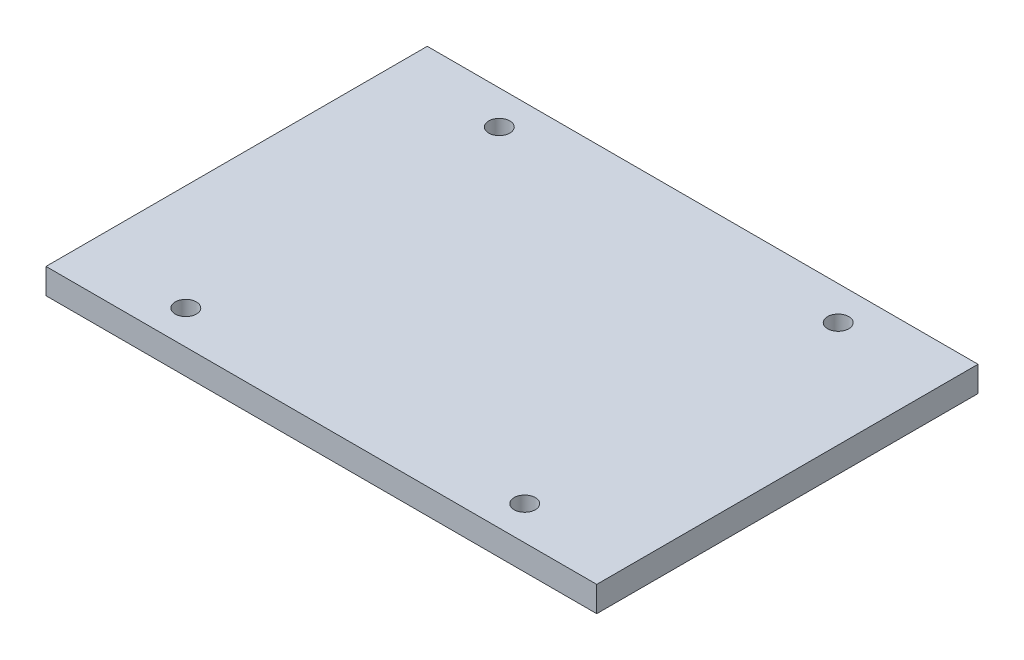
ISO-10303-21;
HEADER;
FILE_DESCRIPTION(('STEP AP214'),'2;1');
FILE_NAME('part.step','',(''),(''),'','','');
FILE_SCHEMA(('AUTOMOTIVE_DESIGN { 1 0 10303 214 1 1 1 1 }'));
ENDSEC;
DATA;
#1=APPLICATION_CONTEXT('core data for automotive mechanical design processes');
#2=APPLICATION_PROTOCOL_DEFINITION('international standard','automotive_design',2000,#1);
#3=PRODUCT_CONTEXT('',#1,'mechanical');
#4=PRODUCT('Part','Part','',(#3));
#5=PRODUCT_RELATED_PRODUCT_CATEGORY('part','',(#4));
#6=PRODUCT_DEFINITION_FORMATION('','',#4);
#7=PRODUCT_DEFINITION_CONTEXT('part definition',#1,'design');
#8=PRODUCT_DEFINITION('design','',#6,#7);
#9=PRODUCT_DEFINITION_SHAPE('','',#8);
#10=(LENGTH_UNIT() NAMED_UNIT(*) SI_UNIT(.MILLI.,.METRE.));
#11=(NAMED_UNIT(*) PLANE_ANGLE_UNIT() SI_UNIT($,.RADIAN.));
#12=(NAMED_UNIT(*) SI_UNIT($,.STERADIAN.) SOLID_ANGLE_UNIT());
#13=UNCERTAINTY_MEASURE_WITH_UNIT(LENGTH_MEASURE(1.E-05),#10,'distance_accuracy_value','');
#14=(GEOMETRIC_REPRESENTATION_CONTEXT(3) GLOBAL_UNCERTAINTY_ASSIGNED_CONTEXT((#13)) GLOBAL_UNIT_ASSIGNED_CONTEXT((#10,
#11,#12)) REPRESENTATION_CONTEXT('',''));
#15=CARTESIAN_POINT('',(0.,0.,0.));
#16=DIRECTION('',(0.,0.,1.));
#17=DIRECTION('',(1.,0.,0.));
#18=AXIS2_PLACEMENT_3D('',#15,#16,#17);
#19=CARTESIAN_POINT('',(0.,3.,0.));
#20=DIRECTION('',(0.,1.,0.));
#21=DIRECTION('',(0.,0.,1.));
#22=AXIS2_PLACEMENT_3D('',#19,#20,#21);
#23=PLANE('',#22);
#24=CARTESIAN_POINT('',(20.,3.,18.5));
#25=DIRECTION('',(0.,1.,0.));
#26=DIRECTION('',(0.,0.,1.));
#27=AXIS2_PLACEMENT_3D('',#24,#25,#26);
#28=CIRCLE('',#27,1.25);
#29=CARTESIAN_POINT('',(20.,3.,19.75));
#30=VERTEX_POINT('',#29);
#31=EDGE_CURVE('E146',#30,#30,#28,.T.);
#32=ORIENTED_EDGE('',*,*,#31,.F.);
#33=EDGE_LOOP('',(#32));
#34=FACE_BOUND('',#33,.T.);
#35=CARTESIAN_POINT('',(-20.,3.,-18.5));
#36=DIRECTION('',(0.,1.,0.));
#37=DIRECTION('',(0.,0.,1.));
#38=AXIS2_PLACEMENT_3D('',#35,#36,#37);
#39=CIRCLE('',#38,1.25);
#40=CARTESIAN_POINT('',(-20.,3.,-17.25));
#41=VERTEX_POINT('',#40);
#42=EDGE_CURVE('E116',#41,#41,#39,.T.);
#43=ORIENTED_EDGE('',*,*,#42,.F.);
#44=EDGE_LOOP('',(#43));
#45=FACE_BOUND('',#44,.T.);
#46=DIRECTION('',(0.,0.,1.));
#47=VECTOR('',#46,1.);
#48=CARTESIAN_POINT('',(-32.5,3.,22.5));
#49=LINE('',#48,#47);
#50=CARTESIAN_POINT('',(-32.5,3.,-22.5));
#51=VERTEX_POINT('',#50);
#52=CARTESIAN_POINT('',(-32.5,3.,22.5));
#53=VERTEX_POINT('',#52);
#54=EDGE_CURVE('E96',#51,#53,#49,.T.);
#55=ORIENTED_EDGE('',*,*,#54,.T.);
#56=DIRECTION('',(1.,0.,0.));
#57=VECTOR('',#56,1.);
#58=CARTESIAN_POINT('',(32.5,3.,22.5));
#59=LINE('',#58,#57);
#60=CARTESIAN_POINT('',(32.5,3.,22.5));
#61=VERTEX_POINT('',#60);
#62=EDGE_CURVE('E91',#53,#61,#59,.T.);
#63=ORIENTED_EDGE('',*,*,#62,.T.);
#64=DIRECTION('',(0.,0.,-1.));
#65=VECTOR('',#64,1.);
#66=CARTESIAN_POINT('',(32.5,3.,22.5));
#67=LINE('',#66,#65);
#68=CARTESIAN_POINT('',(32.5,3.,-22.5));
#69=VERTEX_POINT('',#68);
#70=EDGE_CURVE('E94',#61,#69,#67,.T.);
#71=ORIENTED_EDGE('',*,*,#70,.T.);
#72=DIRECTION('',(-1.,0.,0.));
#73=VECTOR('',#72,1.);
#74=CARTESIAN_POINT('',(32.5,3.,-22.5));
#75=LINE('',#74,#73);
#76=EDGE_CURVE('E61',#69,#51,#75,.T.);
#77=ORIENTED_EDGE('',*,*,#76,.T.);
#78=EDGE_LOOP('',(#55,#63,#71,#77));
#79=FACE_BOUND('',#78,.T.);
#80=CARTESIAN_POINT('',(-20.,3.,18.5));
#81=DIRECTION('',(0.,1.,0.));
#82=DIRECTION('',(0.,0.,1.));
#83=AXIS2_PLACEMENT_3D('',#80,#81,#82);
#84=CIRCLE('',#83,1.25);
#85=CARTESIAN_POINT('',(-20.,3.,19.75));
#86=VERTEX_POINT('',#85);
#87=EDGE_CURVE('E138',#86,#86,#84,.T.);
#88=ORIENTED_EDGE('',*,*,#87,.F.);
#89=EDGE_LOOP('',(#88));
#90=FACE_BOUND('',#89,.T.);
#91=CARTESIAN_POINT('',(20.,3.,-18.5));
#92=DIRECTION('',(0.,1.,0.));
#93=DIRECTION('',(0.,0.,1.));
#94=AXIS2_PLACEMENT_3D('',#91,#92,#93);
#95=CIRCLE('',#94,1.25);
#96=CARTESIAN_POINT('',(20.,3.,-17.25));
#97=VERTEX_POINT('',#96);
#98=EDGE_CURVE('E154',#97,#97,#95,.T.);
#99=ORIENTED_EDGE('',*,*,#98,.F.);
#100=EDGE_LOOP('',(#99));
#101=FACE_BOUND('',#100,.T.);
#102=ADVANCED_FACE('F43',(#34,#45,#79,#90,#101),#23,.T.);
#103=CARTESIAN_POINT('',(0.,0.,0.));
#104=DIRECTION('',(0.,1.,0.));
#105=DIRECTION('',(0.,0.,1.));
#106=AXIS2_PLACEMENT_3D('',#103,#104,#105);
#107=PLANE('',#106);
#108=DIRECTION('',(0.,0.,1.));
#109=VECTOR('',#108,1.);
#110=CARTESIAN_POINT('',(-32.5,0.,22.5));
#111=LINE('',#110,#109);
#112=CARTESIAN_POINT('',(-32.5,0.,-22.5));
#113=VERTEX_POINT('',#112);
#114=CARTESIAN_POINT('',(-32.5,0.,22.5));
#115=VERTEX_POINT('',#114);
#116=EDGE_CURVE('E112',#113,#115,#111,.T.);
#117=ORIENTED_EDGE('',*,*,#116,.F.);
#118=DIRECTION('',(-1.,0.,0.));
#119=VECTOR('',#118,1.);
#120=CARTESIAN_POINT('',(32.5,0.,-22.5));
#121=LINE('',#120,#119);
#122=CARTESIAN_POINT('',(32.5,0.,-22.5));
#123=VERTEX_POINT('',#122);
#124=EDGE_CURVE('E84',#123,#113,#121,.T.);
#125=ORIENTED_EDGE('',*,*,#124,.F.);
#126=DIRECTION('',(0.,0.,-1.));
#127=VECTOR('',#126,1.);
#128=CARTESIAN_POINT('',(32.5,0.,22.5));
#129=LINE('',#128,#127);
#130=CARTESIAN_POINT('',(32.5,0.,22.5));
#131=VERTEX_POINT('',#130);
#132=EDGE_CURVE('E78',#131,#123,#129,.T.);
#133=ORIENTED_EDGE('',*,*,#132,.F.);
#134=DIRECTION('',(1.,0.,0.));
#135=VECTOR('',#134,1.);
#136=CARTESIAN_POINT('',(32.5,0.,22.5));
#137=LINE('',#136,#135);
#138=EDGE_CURVE('E101',#115,#131,#137,.T.);
#139=ORIENTED_EDGE('',*,*,#138,.F.);
#140=EDGE_LOOP('',(#117,#125,#133,#139));
#141=FACE_BOUND('',#140,.T.);
#142=CARTESIAN_POINT('',(-20.,0.,-18.5));
#143=DIRECTION('',(0.,1.,0.));
#144=DIRECTION('',(0.,0.,1.));
#145=AXIS2_PLACEMENT_3D('',#142,#143,#144);
#146=CIRCLE('',#145,1.25);
#147=CARTESIAN_POINT('',(-20.,0.,-17.25));
#148=VERTEX_POINT('',#147);
#149=EDGE_CURVE('E134',#148,#148,#146,.T.);
#150=ORIENTED_EDGE('',*,*,#149,.T.);
#151=EDGE_LOOP('',(#150));
#152=FACE_BOUND('',#151,.T.);
#153=CARTESIAN_POINT('',(-20.,0.,18.5));
#154=DIRECTION('',(0.,1.,0.));
#155=DIRECTION('',(0.,0.,1.));
#156=AXIS2_PLACEMENT_3D('',#153,#154,#155);
#157=CIRCLE('',#156,1.25);
#158=CARTESIAN_POINT('',(-20.,0.,19.75));
#159=VERTEX_POINT('',#158);
#160=EDGE_CURVE('E142',#159,#159,#157,.T.);
#161=ORIENTED_EDGE('',*,*,#160,.T.);
#162=EDGE_LOOP('',(#161));
#163=FACE_BOUND('',#162,.T.);
#164=CARTESIAN_POINT('',(20.,0.,18.5));
#165=DIRECTION('',(0.,1.,0.));
#166=DIRECTION('',(0.,0.,1.));
#167=AXIS2_PLACEMENT_3D('',#164,#165,#166);
#168=CIRCLE('',#167,1.25);
#169=CARTESIAN_POINT('',(20.,0.,19.75));
#170=VERTEX_POINT('',#169);
#171=EDGE_CURVE('E150',#170,#170,#168,.T.);
#172=ORIENTED_EDGE('',*,*,#171,.T.);
#173=EDGE_LOOP('',(#172));
#174=FACE_BOUND('',#173,.T.);
#175=CARTESIAN_POINT('',(20.,0.,-18.5));
#176=DIRECTION('',(0.,1.,0.));
#177=DIRECTION('',(0.,0.,1.));
#178=AXIS2_PLACEMENT_3D('',#175,#176,#177);
#179=CIRCLE('',#178,1.25);
#180=CARTESIAN_POINT('',(20.,0.,-17.25));
#181=VERTEX_POINT('',#180);
#182=EDGE_CURVE('E158',#181,#181,#179,.T.);
#183=ORIENTED_EDGE('',*,*,#182,.T.);
#184=EDGE_LOOP('',(#183));
#185=FACE_BOUND('',#184,.T.);
#186=ADVANCED_FACE('F129',(#141,#152,#163,#174,#185),#107,.F.);
#187=CARTESIAN_POINT('',(-32.5,3.,22.5));
#188=DIRECTION('',(1.,0.,0.));
#189=DIRECTION('',(0.,0.,-1.));
#190=AXIS2_PLACEMENT_3D('',#187,#188,#189);
#191=PLANE('',#190);
#192=ORIENTED_EDGE('',*,*,#116,.T.);
#193=DIRECTION('',(0.,-1.,0.));
#194=VECTOR('',#193,1.);
#195=CARTESIAN_POINT('',(-32.5,3.,22.5));
#196=LINE('',#195,#194);
#197=EDGE_CURVE('E11',#53,#115,#196,.T.);
#198=ORIENTED_EDGE('',*,*,#197,.F.);
#199=ORIENTED_EDGE('',*,*,#54,.F.);
#200=DIRECTION('',(0.,-1.,0.));
#201=VECTOR('',#200,1.);
#202=CARTESIAN_POINT('',(-32.5,3.,-22.5));
#203=LINE('',#202,#201);
#204=EDGE_CURVE('E108',#51,#113,#203,.T.);
#205=ORIENTED_EDGE('',*,*,#204,.T.);
#206=EDGE_LOOP('',(#192,#198,#199,#205));
#207=FACE_BOUND('',#206,.T.);
#208=ADVANCED_FACE('F45',(#207),#191,.F.);
#209=CARTESIAN_POINT('',(32.5,3.,22.5));
#210=DIRECTION('',(0.,0.,-1.));
#211=DIRECTION('',(-1.,0.,0.));
#212=AXIS2_PLACEMENT_3D('',#209,#210,#211);
#213=PLANE('',#212);
#214=ORIENTED_EDGE('',*,*,#138,.T.);
#215=DIRECTION('',(0.,-1.,0.));
#216=VECTOR('',#215,1.);
#217=CARTESIAN_POINT('',(32.5,3.,22.5));
#218=LINE('',#217,#216);
#219=EDGE_CURVE('E53',#61,#131,#218,.T.);
#220=ORIENTED_EDGE('',*,*,#219,.F.);
#221=ORIENTED_EDGE('',*,*,#62,.F.);
#222=ORIENTED_EDGE('',*,*,#197,.T.);
#223=EDGE_LOOP('',(#214,#220,#221,#222));
#224=FACE_BOUND('',#223,.T.);
#225=ADVANCED_FACE('F100',(#224),#213,.F.);
#226=CARTESIAN_POINT('',(32.5,3.,22.5));
#227=DIRECTION('',(-1.,0.,0.));
#228=DIRECTION('',(0.,0.,1.));
#229=AXIS2_PLACEMENT_3D('',#226,#227,#228);
#230=PLANE('',#229);
#231=ORIENTED_EDGE('',*,*,#132,.T.);
#232=DIRECTION('',(0.,-1.,0.));
#233=VECTOR('',#232,1.);
#234=CARTESIAN_POINT('',(32.5,3.,-22.5));
#235=LINE('',#234,#233);
#236=EDGE_CURVE('E103',#69,#123,#235,.T.);
#237=ORIENTED_EDGE('',*,*,#236,.F.);
#238=ORIENTED_EDGE('',*,*,#70,.F.);
#239=ORIENTED_EDGE('',*,*,#219,.T.);
#240=EDGE_LOOP('',(#231,#237,#238,#239));
#241=FACE_BOUND('',#240,.T.);
#242=ADVANCED_FACE('F104',(#241),#230,.F.);
#243=CARTESIAN_POINT('',(32.5,3.,-22.5));
#244=DIRECTION('',(0.,0.,1.));
#245=DIRECTION('',(1.,0.,0.));
#246=AXIS2_PLACEMENT_3D('',#243,#244,#245);
#247=PLANE('',#246);
#248=ORIENTED_EDGE('',*,*,#124,.T.);
#249=ORIENTED_EDGE('',*,*,#204,.F.);
#250=ORIENTED_EDGE('',*,*,#76,.F.);
#251=ORIENTED_EDGE('',*,*,#236,.T.);
#252=EDGE_LOOP('',(#248,#249,#250,#251));
#253=FACE_BOUND('',#252,.T.);
#254=ADVANCED_FACE('F126',(#253),#247,.F.);
#255=CARTESIAN_POINT('',(-20.,3.,-18.5));
#256=DIRECTION('',(0.,-1.,0.));
#257=DIRECTION('',(0.,0.,-1.));
#258=AXIS2_PLACEMENT_3D('',#255,#256,#257);
#259=CYLINDRICAL_SURFACE('',#258,1.25);
#260=ORIENTED_EDGE('',*,*,#42,.T.);
#261=EDGE_LOOP('',(#260));
#262=FACE_BOUND('',#261,.T.);
#263=ORIENTED_EDGE('',*,*,#149,.F.);
#264=EDGE_LOOP('',(#263));
#265=FACE_BOUND('',#264,.T.);
#266=ADVANCED_FACE('F179',(#262,#265),#259,.F.);
#267=CARTESIAN_POINT('',(-20.,3.,18.5));
#268=DIRECTION('',(0.,-1.,0.));
#269=DIRECTION('',(0.,0.,-1.));
#270=AXIS2_PLACEMENT_3D('',#267,#268,#269);
#271=CYLINDRICAL_SURFACE('',#270,1.25);
#272=ORIENTED_EDGE('',*,*,#87,.T.);
#273=EDGE_LOOP('',(#272));
#274=FACE_BOUND('',#273,.T.);
#275=ORIENTED_EDGE('',*,*,#160,.F.);
#276=EDGE_LOOP('',(#275));
#277=FACE_BOUND('',#276,.T.);
#278=ADVANCED_FACE('F233',(#274,#277),#271,.F.);
#279=CARTESIAN_POINT('',(20.,3.,18.5));
#280=DIRECTION('',(0.,-1.,0.));
#281=DIRECTION('',(0.,0.,-1.));
#282=AXIS2_PLACEMENT_3D('',#279,#280,#281);
#283=CYLINDRICAL_SURFACE('',#282,1.25);
#284=ORIENTED_EDGE('',*,*,#31,.T.);
#285=EDGE_LOOP('',(#284));
#286=FACE_BOUND('',#285,.T.);
#287=ORIENTED_EDGE('',*,*,#171,.F.);
#288=EDGE_LOOP('',(#287));
#289=FACE_BOUND('',#288,.T.);
#290=ADVANCED_FACE('F242',(#286,#289),#283,.F.);
#291=CARTESIAN_POINT('',(20.,3.,-18.5));
#292=DIRECTION('',(0.,-1.,0.));
#293=DIRECTION('',(0.,0.,-1.));
#294=AXIS2_PLACEMENT_3D('',#291,#292,#293);
#295=CYLINDRICAL_SURFACE('',#294,1.25);
#296=ORIENTED_EDGE('',*,*,#98,.T.);
#297=EDGE_LOOP('',(#296));
#298=FACE_BOUND('',#297,.T.);
#299=ORIENTED_EDGE('',*,*,#182,.F.);
#300=EDGE_LOOP('',(#299));
#301=FACE_BOUND('',#300,.T.);
#302=ADVANCED_FACE('F166',(#298,#301),#295,.F.);
#303=CLOSED_SHELL('',(#102,#186,#208,#225,#242,#254,#266,#278,#290,#302));
#304=MANIFOLD_SOLID_BREP('B2',#303);
#305=ADVANCED_BREP_SHAPE_REPRESENTATION('',(#18,#304),#14);
#306=SHAPE_DEFINITION_REPRESENTATION(#9,#305);
ENDSEC;
END-ISO-10303-21;
